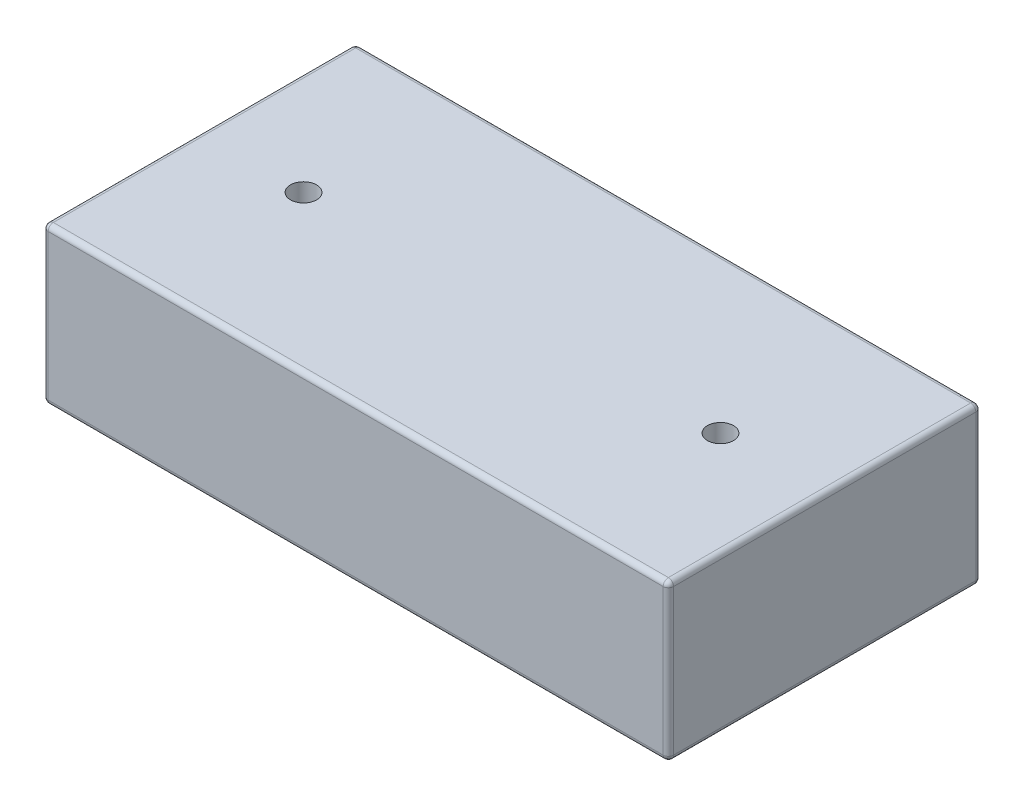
ISO-10303-21;
HEADER;
FILE_DESCRIPTION(('STEP AP214'),'2;1');
FILE_NAME('part.step','',(''),(''),'','','');
FILE_SCHEMA(('AUTOMOTIVE_DESIGN { 1 0 10303 214 1 1 1 1 }'));
ENDSEC;
DATA;
#1=APPLICATION_CONTEXT('core data for automotive mechanical design processes');
#2=APPLICATION_PROTOCOL_DEFINITION('international standard','automotive_design',2000,#1);
#3=PRODUCT_CONTEXT('',#1,'mechanical');
#4=PRODUCT('Part','Part','',(#3));
#5=PRODUCT_RELATED_PRODUCT_CATEGORY('part','',(#4));
#6=PRODUCT_DEFINITION_FORMATION('','',#4);
#7=PRODUCT_DEFINITION_CONTEXT('part definition',#1,'design');
#8=PRODUCT_DEFINITION('design','',#6,#7);
#9=PRODUCT_DEFINITION_SHAPE('','',#8);
#10=(LENGTH_UNIT() NAMED_UNIT(*) SI_UNIT(.MILLI.,.METRE.));
#11=(NAMED_UNIT(*) PLANE_ANGLE_UNIT() SI_UNIT($,.RADIAN.));
#12=(NAMED_UNIT(*) SI_UNIT($,.STERADIAN.) SOLID_ANGLE_UNIT());
#13=UNCERTAINTY_MEASURE_WITH_UNIT(LENGTH_MEASURE(1.E-05),#10,'distance_accuracy_value','');
#14=(GEOMETRIC_REPRESENTATION_CONTEXT(3) GLOBAL_UNCERTAINTY_ASSIGNED_CONTEXT((#13)) GLOBAL_UNIT_ASSIGNED_CONTEXT((#10,
#11,#12)) REPRESENTATION_CONTEXT('',''));
#15=CARTESIAN_POINT('',(0.,0.,0.));
#16=DIRECTION('',(0.,0.,1.));
#17=DIRECTION('',(1.,0.,0.));
#18=AXIS2_PLACEMENT_3D('',#15,#16,#17);
#19=CARTESIAN_POINT('',(304.8,76.2,-152.4));
#20=DIRECTION('',(-1.,0.,0.));
#21=DIRECTION('',(0.,0.,1.));
#22=AXIS2_PLACEMENT_3D('',#19,#20,#21);
#23=PLANE('',#22);
#24=DIRECTION('',(0.,0.,-1.));
#25=VECTOR('',#24,1.);
#26=CARTESIAN_POINT('',(304.8,-71.12,-152.4));
#27=LINE('',#26,#25);
#28=CARTESIAN_POINT('',(304.8,-71.12,147.32));
#29=VERTEX_POINT('',#28);
#30=CARTESIAN_POINT('',(304.8,-71.12,-147.32));
#31=VERTEX_POINT('',#30);
#32=EDGE_CURVE('E197',#29,#31,#27,.T.);
#33=ORIENTED_EDGE('',*,*,#32,.T.);
#34=DIRECTION('',(0.,-1.,0.));
#35=VECTOR('',#34,1.);
#36=CARTESIAN_POINT('',(304.8,76.2,-147.32));
#37=LINE('',#36,#35);
#38=CARTESIAN_POINT('',(304.8,71.12,-147.32));
#39=VERTEX_POINT('',#38);
#40=EDGE_CURVE('E44',#31,#39,#37,.F.);
#41=ORIENTED_EDGE('',*,*,#40,.T.);
#42=DIRECTION('',(0.,0.,-1.));
#43=VECTOR('',#42,1.);
#44=CARTESIAN_POINT('',(304.8,71.12,-152.4));
#45=LINE('',#44,#43);
#46=CARTESIAN_POINT('',(304.8,71.12,147.32));
#47=VERTEX_POINT('',#46);
#48=EDGE_CURVE('E172',#39,#47,#45,.F.);
#49=ORIENTED_EDGE('',*,*,#48,.T.);
#50=DIRECTION('',(0.,-1.,0.));
#51=VECTOR('',#50,1.);
#52=CARTESIAN_POINT('',(304.8,76.2,147.32));
#53=LINE('',#52,#51);
#54=EDGE_CURVE('E240',#47,#29,#53,.T.);
#55=ORIENTED_EDGE('',*,*,#54,.T.);
#56=EDGE_LOOP('',(#33,#41,#49,#55));
#57=FACE_BOUND('',#56,.T.);
#58=ADVANCED_FACE('F37',(#57),#23,.F.);
#59=CARTESIAN_POINT('',(304.8,76.2,-152.4));
#60=DIRECTION('',(0.,0.,1.));
#61=DIRECTION('',(1.,0.,0.));
#62=AXIS2_PLACEMENT_3D('',#59,#60,#61);
#63=PLANE('',#62);
#64=DIRECTION('',(-1.,0.,0.));
#65=VECTOR('',#64,1.);
#66=CARTESIAN_POINT('',(304.8,71.12,-152.4));
#67=LINE('',#66,#65);
#68=CARTESIAN_POINT('',(-299.72,71.12,-152.4));
#69=VERTEX_POINT('',#68);
#70=CARTESIAN_POINT('',(299.72,71.12,-152.4));
#71=VERTEX_POINT('',#70);
#72=EDGE_CURVE('E146',#69,#71,#67,.F.);
#73=ORIENTED_EDGE('',*,*,#72,.T.);
#74=DIRECTION('',(0.,-1.,0.));
#75=VECTOR('',#74,1.);
#76=CARTESIAN_POINT('',(299.72,76.2,-152.4));
#77=LINE('',#76,#75);
#78=CARTESIAN_POINT('',(299.72,-71.12,-152.4));
#79=VERTEX_POINT('',#78);
#80=EDGE_CURVE('E238',#71,#79,#77,.T.);
#81=ORIENTED_EDGE('',*,*,#80,.T.);
#82=DIRECTION('',(-1.,0.,0.));
#83=VECTOR('',#82,1.);
#84=CARTESIAN_POINT('',(-304.8,-71.12,-152.4));
#85=LINE('',#84,#83);
#86=CARTESIAN_POINT('',(-299.72,-71.12,-152.4));
#87=VERTEX_POINT('',#86);
#88=EDGE_CURVE('E147',#79,#87,#85,.T.);
#89=ORIENTED_EDGE('',*,*,#88,.T.);
#90=DIRECTION('',(0.,-1.,0.));
#91=VECTOR('',#90,1.);
#92=CARTESIAN_POINT('',(-299.72,76.2,-152.4));
#93=LINE('',#92,#91);
#94=EDGE_CURVE('E207',#87,#69,#93,.F.);
#95=ORIENTED_EDGE('',*,*,#94,.T.);
#96=EDGE_LOOP('',(#73,#81,#89,#95));
#97=FACE_BOUND('',#96,.T.);
#98=ADVANCED_FACE('F263',(#97),#63,.F.);
#99=CARTESIAN_POINT('',(-304.8,76.2,-152.4));
#100=DIRECTION('',(1.,0.,0.));
#101=DIRECTION('',(0.,0.,-1.));
#102=AXIS2_PLACEMENT_3D('',#99,#100,#101);
#103=PLANE('',#102);
#104=DIRECTION('',(0.,0.,1.));
#105=VECTOR('',#104,1.);
#106=CARTESIAN_POINT('',(-304.8,-71.12,152.4));
#107=LINE('',#106,#105);
#108=CARTESIAN_POINT('',(-304.8,-71.12,-147.32));
#109=VERTEX_POINT('',#108);
#110=CARTESIAN_POINT('',(-304.8,-71.12,147.32));
#111=VERTEX_POINT('',#110);
#112=EDGE_CURVE('E180',#109,#111,#107,.T.);
#113=ORIENTED_EDGE('',*,*,#112,.T.);
#114=DIRECTION('',(0.,-1.,0.));
#115=VECTOR('',#114,1.);
#116=CARTESIAN_POINT('',(-304.8,76.2,147.32));
#117=LINE('',#116,#115);
#118=CARTESIAN_POINT('',(-304.8,71.12,147.32));
#119=VERTEX_POINT('',#118);
#120=EDGE_CURVE('E219',#111,#119,#117,.F.);
#121=ORIENTED_EDGE('',*,*,#120,.T.);
#122=DIRECTION('',(0.,0.,1.));
#123=VECTOR('',#122,1.);
#124=CARTESIAN_POINT('',(-304.8,71.12,-152.4));
#125=LINE('',#124,#123);
#126=CARTESIAN_POINT('',(-304.8,71.12,-147.32));
#127=VERTEX_POINT('',#126);
#128=EDGE_CURVE('E178',#119,#127,#125,.F.);
#129=ORIENTED_EDGE('',*,*,#128,.T.);
#130=DIRECTION('',(0.,-1.,0.));
#131=VECTOR('',#130,1.);
#132=CARTESIAN_POINT('',(-304.8,76.2,-147.32));
#133=LINE('',#132,#131);
#134=EDGE_CURVE('E205',#127,#109,#133,.T.);
#135=ORIENTED_EDGE('',*,*,#134,.T.);
#136=EDGE_LOOP('',(#113,#121,#129,#135));
#137=FACE_BOUND('',#136,.T.);
#138=ADVANCED_FACE('F299',(#137),#103,.F.);
#139=CARTESIAN_POINT('',(304.8,76.2,152.4));
#140=DIRECTION('',(0.,0.,-1.));
#141=DIRECTION('',(-1.,0.,0.));
#142=AXIS2_PLACEMENT_3D('',#139,#140,#141);
#143=PLANE('',#142);
#144=DIRECTION('',(1.,0.,0.));
#145=VECTOR('',#144,1.);
#146=CARTESIAN_POINT('',(304.8,-71.12,152.4));
#147=LINE('',#146,#145);
#148=CARTESIAN_POINT('',(-299.72,-71.12,152.4));
#149=VERTEX_POINT('',#148);
#150=CARTESIAN_POINT('',(299.72,-71.12,152.4));
#151=VERTEX_POINT('',#150);
#152=EDGE_CURVE('E195',#149,#151,#147,.T.);
#153=ORIENTED_EDGE('',*,*,#152,.T.);
#154=DIRECTION('',(0.,-1.,0.));
#155=VECTOR('',#154,1.);
#156=CARTESIAN_POINT('',(299.72,76.2,152.4));
#157=LINE('',#156,#155);
#158=CARTESIAN_POINT('',(299.72,71.12,152.4));
#159=VERTEX_POINT('',#158);
#160=EDGE_CURVE('E11',#151,#159,#157,.F.);
#161=ORIENTED_EDGE('',*,*,#160,.T.);
#162=DIRECTION('',(1.,0.,0.));
#163=VECTOR('',#162,1.);
#164=CARTESIAN_POINT('',(304.8,71.12,152.4));
#165=LINE('',#164,#163);
#166=CARTESIAN_POINT('',(-299.72,71.12,152.4));
#167=VERTEX_POINT('',#166);
#168=EDGE_CURVE('E175',#159,#167,#165,.F.);
#169=ORIENTED_EDGE('',*,*,#168,.T.);
#170=DIRECTION('',(0.,-1.,0.));
#171=VECTOR('',#170,1.);
#172=CARTESIAN_POINT('',(-299.72,76.2,152.4));
#173=LINE('',#172,#171);
#174=EDGE_CURVE('E217',#167,#149,#173,.T.);
#175=ORIENTED_EDGE('',*,*,#174,.T.);
#176=EDGE_LOOP('',(#153,#161,#169,#175));
#177=FACE_BOUND('',#176,.T.);
#178=ADVANCED_FACE('F291',(#177),#143,.F.);
#179=CARTESIAN_POINT('',(304.8,76.2,-152.4));
#180=DIRECTION('',(0.,-1.,0.));
#181=DIRECTION('',(0.,0.,-1.));
#182=AXIS2_PLACEMENT_3D('',#179,#180,#181);
#183=PLANE('',#182);
#184=DIRECTION('',(1.,0.,0.));
#185=VECTOR('',#184,1.);
#186=CARTESIAN_POINT('',(304.8,76.2,147.32));
#187=LINE('',#186,#185);
#188=CARTESIAN_POINT('',(-299.72,76.2,147.32));
#189=VERTEX_POINT('',#188);
#190=CARTESIAN_POINT('',(299.72,76.2,147.32));
#191=VERTEX_POINT('',#190);
#192=EDGE_CURVE('E158',#189,#191,#187,.T.);
#193=ORIENTED_EDGE('',*,*,#192,.T.);
#194=DIRECTION('',(0.,0.,-1.));
#195=VECTOR('',#194,1.);
#196=CARTESIAN_POINT('',(299.72,76.2,-152.4));
#197=LINE('',#196,#195);
#198=CARTESIAN_POINT('',(299.72,76.2,-147.32));
#199=VERTEX_POINT('',#198);
#200=EDGE_CURVE('E157',#191,#199,#197,.T.);
#201=ORIENTED_EDGE('',*,*,#200,.T.);
#202=DIRECTION('',(-1.,0.,0.));
#203=VECTOR('',#202,1.);
#204=CARTESIAN_POINT('',(304.8,76.2,-147.32));
#205=LINE('',#204,#203);
#206=CARTESIAN_POINT('',(-299.72,76.2,-147.32));
#207=VERTEX_POINT('',#206);
#208=EDGE_CURVE('E143',#199,#207,#205,.T.);
#209=ORIENTED_EDGE('',*,*,#208,.T.);
#210=DIRECTION('',(0.,0.,1.));
#211=VECTOR('',#210,1.);
#212=CARTESIAN_POINT('',(-299.72,76.2,-152.4));
#213=LINE('',#212,#211);
#214=EDGE_CURVE('E154',#207,#189,#213,.T.);
#215=ORIENTED_EDGE('',*,*,#214,.T.);
#216=EDGE_LOOP('',(#193,#201,#209,#215));
#217=FACE_BOUND('',#216,.T.);
#218=CARTESIAN_POINT('',(203.2,76.2,0.));
#219=DIRECTION('',(0.,1.,0.));
#220=DIRECTION('',(0.,0.,1.));
#221=AXIS2_PLACEMENT_3D('',#218,#219,#220);
#222=CIRCLE('',#221,12.7);
#223=CARTESIAN_POINT('',(203.2,76.2,12.7));
#224=VERTEX_POINT('',#223);
#225=EDGE_CURVE('E273',#224,#224,#222,.T.);
#226=ORIENTED_EDGE('',*,*,#225,.F.);
#227=EDGE_LOOP('',(#226));
#228=FACE_BOUND('',#227,.T.);
#229=CARTESIAN_POINT('',(-203.2,76.2,0.));
#230=DIRECTION('',(0.,1.,0.));
#231=DIRECTION('',(0.,0.,1.));
#232=AXIS2_PLACEMENT_3D('',#229,#230,#231);
#233=CIRCLE('',#232,12.7);
#234=CARTESIAN_POINT('',(-203.2,76.2,12.7));
#235=VERTEX_POINT('',#234);
#236=EDGE_CURVE('E166',#235,#235,#233,.T.);
#237=ORIENTED_EDGE('',*,*,#236,.F.);
#238=EDGE_LOOP('',(#237));
#239=FACE_BOUND('',#238,.T.);
#240=ADVANCED_FACE('F152',(#217,#228,#239),#183,.F.);
#241=CARTESIAN_POINT('',(304.8,-76.2,-152.4));
#242=DIRECTION('',(0.,-1.,0.));
#243=DIRECTION('',(0.,0.,-1.));
#244=AXIS2_PLACEMENT_3D('',#241,#242,#243);
#245=PLANE('',#244);
#246=DIRECTION('',(1.,0.,0.));
#247=VECTOR('',#246,1.);
#248=CARTESIAN_POINT('',(-304.8,-76.2,147.32));
#249=LINE('',#248,#247);
#250=CARTESIAN_POINT('',(299.72,-76.2,147.32));
#251=VERTEX_POINT('',#250);
#252=CARTESIAN_POINT('',(-299.72,-76.2,147.32));
#253=VERTEX_POINT('',#252);
#254=EDGE_CURVE('E189',#251,#253,#249,.F.);
#255=ORIENTED_EDGE('',*,*,#254,.T.);
#256=DIRECTION('',(0.,0.,1.));
#257=VECTOR('',#256,1.);
#258=CARTESIAN_POINT('',(-299.72,-76.2,-152.4));
#259=LINE('',#258,#257);
#260=CARTESIAN_POINT('',(-299.72,-76.2,-147.32));
#261=VERTEX_POINT('',#260);
#262=EDGE_CURVE('E192',#253,#261,#259,.F.);
#263=ORIENTED_EDGE('',*,*,#262,.T.);
#264=DIRECTION('',(-1.,0.,0.));
#265=VECTOR('',#264,1.);
#266=CARTESIAN_POINT('',(304.8,-76.2,-147.32));
#267=LINE('',#266,#265);
#268=CARTESIAN_POINT('',(299.72,-76.2,-147.32));
#269=VERTEX_POINT('',#268);
#270=EDGE_CURVE('E183',#261,#269,#267,.F.);
#271=ORIENTED_EDGE('',*,*,#270,.T.);
#272=DIRECTION('',(0.,0.,-1.));
#273=VECTOR('',#272,1.);
#274=CARTESIAN_POINT('',(299.72,-76.2,152.4));
#275=LINE('',#274,#273);
#276=EDGE_CURVE('E186',#269,#251,#275,.F.);
#277=ORIENTED_EDGE('',*,*,#276,.T.);
#278=EDGE_LOOP('',(#255,#263,#271,#277));
#279=FACE_BOUND('',#278,.T.);
#280=CARTESIAN_POINT('',(203.2,-76.2,0.));
#281=DIRECTION('',(0.,1.,0.));
#282=DIRECTION('',(0.,0.,1.));
#283=AXIS2_PLACEMENT_3D('',#280,#281,#282);
#284=CIRCLE('',#283,12.7);
#285=CARTESIAN_POINT('',(203.2,-76.2,12.7));
#286=VERTEX_POINT('',#285);
#287=EDGE_CURVE('E282',#286,#286,#284,.T.);
#288=ORIENTED_EDGE('',*,*,#287,.T.);
#289=EDGE_LOOP('',(#288));
#290=FACE_BOUND('',#289,.T.);
#291=CARTESIAN_POINT('',(-203.2,-76.2,0.));
#292=DIRECTION('',(0.,1.,0.));
#293=DIRECTION('',(0.,0.,1.));
#294=AXIS2_PLACEMENT_3D('',#291,#292,#293);
#295=CIRCLE('',#294,12.7);
#296=CARTESIAN_POINT('',(-203.2,-76.2,12.7));
#297=VERTEX_POINT('',#296);
#298=EDGE_CURVE('E163',#297,#297,#295,.T.);
#299=ORIENTED_EDGE('',*,*,#298,.T.);
#300=EDGE_LOOP('',(#299));
#301=FACE_BOUND('',#300,.T.);
#302=ADVANCED_FACE('F290',(#279,#290,#301),#245,.T.);
#303=CARTESIAN_POINT('',(-203.2,-76.2,0.));
#304=DIRECTION('',(0.,1.,0.));
#305=DIRECTION('',(0.,0.,1.));
#306=AXIS2_PLACEMENT_3D('',#303,#304,#305);
#307=CYLINDRICAL_SURFACE('',#306,12.7);
#308=CARTESIAN_POINT('',(-203.2,-76.2,12.7));
#309=CARTESIAN_POINT('',(-203.2,-74.6125,12.7));
#310=CARTESIAN_POINT('',(-203.2,-73.025,12.7));
#311=CARTESIAN_POINT('',(-203.2,-69.85,12.7));
#312=CARTESIAN_POINT('',(-203.2,-68.2625,12.7));
#313=CARTESIAN_POINT('',(-203.2,-65.0875,12.7));
#314=CARTESIAN_POINT('',(-203.2,-63.5,12.7));
#315=CARTESIAN_POINT('',(-203.2,-60.325,12.7));
#316=CARTESIAN_POINT('',(-203.2,-58.7375,12.7));
#317=CARTESIAN_POINT('',(-203.2,-55.5625,12.7));
#318=CARTESIAN_POINT('',(-203.2,-53.975,12.7));
#319=CARTESIAN_POINT('',(-203.2,-50.8,12.7));
#320=CARTESIAN_POINT('',(-203.2,-49.2125,12.7));
#321=CARTESIAN_POINT('',(-203.2,-46.0375,12.7));
#322=CARTESIAN_POINT('',(-203.2,-44.45,12.7));
#323=CARTESIAN_POINT('',(-203.2,-41.275,12.7));
#324=CARTESIAN_POINT('',(-203.2,-39.6875,12.7));
#325=CARTESIAN_POINT('',(-203.2,-36.5125,12.7));
#326=CARTESIAN_POINT('',(-203.2,-34.925,12.7));
#327=CARTESIAN_POINT('',(-203.2,-31.75,12.7));
#328=CARTESIAN_POINT('',(-203.2,-30.1625,12.7));
#329=CARTESIAN_POINT('',(-203.2,-26.9875,12.7));
#330=CARTESIAN_POINT('',(-203.2,-25.4,12.7));
#331=CARTESIAN_POINT('',(-203.2,-22.225,12.7));
#332=CARTESIAN_POINT('',(-203.2,-20.6375,12.7));
#333=CARTESIAN_POINT('',(-203.2,-17.4625,12.7));
#334=CARTESIAN_POINT('',(-203.2,-15.875,12.7));
#335=CARTESIAN_POINT('',(-203.2,-12.7,12.7));
#336=CARTESIAN_POINT('',(-203.2,-11.1125,12.7));
#337=CARTESIAN_POINT('',(-203.2,-7.93750000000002,12.7));
#338=CARTESIAN_POINT('',(-203.2,-6.35000000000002,12.7));
#339=CARTESIAN_POINT('',(-203.2,-3.17500000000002,12.7));
#340=CARTESIAN_POINT('',(-203.2,-1.58750000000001,12.7));
#341=CARTESIAN_POINT('',(-203.2,1.58749999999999,12.7));
#342=CARTESIAN_POINT('',(-203.2,3.17499999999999,12.7));
#343=CARTESIAN_POINT('',(-203.2,6.34999999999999,12.7));
#344=CARTESIAN_POINT('',(-203.2,7.93749999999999,12.7));
#345=CARTESIAN_POINT('',(-203.2,11.1125,12.7));
#346=CARTESIAN_POINT('',(-203.2,12.7,12.7));
#347=CARTESIAN_POINT('',(-203.2,15.875,12.7));
#348=CARTESIAN_POINT('',(-203.2,17.4625,12.7));
#349=CARTESIAN_POINT('',(-203.2,20.6375,12.7));
#350=CARTESIAN_POINT('',(-203.2,22.225,12.7));
#351=CARTESIAN_POINT('',(-203.2,25.4,12.7));
#352=CARTESIAN_POINT('',(-203.2,26.9875,12.7));
#353=CARTESIAN_POINT('',(-203.2,30.1625,12.7));
#354=CARTESIAN_POINT('',(-203.2,31.75,12.7));
#355=CARTESIAN_POINT('',(-203.2,34.925,12.7));
#356=CARTESIAN_POINT('',(-203.2,36.5125,12.7));
#357=CARTESIAN_POINT('',(-203.2,39.6875,12.7));
#358=CARTESIAN_POINT('',(-203.2,41.275,12.7));
#359=CARTESIAN_POINT('',(-203.2,44.45,12.7));
#360=CARTESIAN_POINT('',(-203.2,46.0375,12.7));
#361=CARTESIAN_POINT('',(-203.2,49.2125,12.7));
#362=CARTESIAN_POINT('',(-203.2,50.8,12.7));
#363=CARTESIAN_POINT('',(-203.2,53.975,12.7));
#364=CARTESIAN_POINT('',(-203.2,55.5625,12.7));
#365=CARTESIAN_POINT('',(-203.2,58.7375,12.7));
#366=CARTESIAN_POINT('',(-203.2,60.325,12.7));
#367=CARTESIAN_POINT('',(-203.2,63.5,12.7));
#368=CARTESIAN_POINT('',(-203.2,65.0875,12.7));
#369=CARTESIAN_POINT('',(-203.2,68.2625,12.7));
#370=CARTESIAN_POINT('',(-203.2,69.85,12.7));
#371=CARTESIAN_POINT('',(-203.2,73.025,12.7));
#372=CARTESIAN_POINT('',(-203.2,74.6125,12.7));
#373=CARTESIAN_POINT('',(-203.2,76.2,12.7));
#374=B_SPLINE_CURVE_WITH_KNOTS('',3,(#308,#309,#310,#311,#312,#313,#314,#315,#316,#317,#318,
#319,#320,#321,#322,#323,#324,#325,#326,#327,#328,#329,#330,#331,#332,#333,#334,#335,#336,#337,
#338,#339,#340,#341,#342,#343,#344,#345,#346,#347,#348,#349,#350,#351,#352,#353,#354,#355,#356,
#357,#358,#359,#360,#361,#362,#363,#364,#365,#366,#367,#368,#369,#370,#371,#372,#373),
.UNSPECIFIED.,.F.,.F.,(4,2,2,2,2,2,2,2,2,2,2,2,2,2,2,2,2,2,2,2,2,2,2,2,2,2,2,2,2,2,2,2,4),(0.,
4.7625,9.52500000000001,14.2875,19.05,23.8125,28.575,33.3375,38.1,42.8625,47.625,52.3875,57.15,
61.9125,66.675,71.4375,76.2,80.9625,85.725,90.4875,95.25,100.0125,104.775,109.5375,114.3,
119.0625,123.825,128.5875,133.35,138.1125,142.875,147.6375,152.4),.UNSPECIFIED.);
#375=EDGE_CURVE('BSEAM287',#297,#235,#374,.T.);
#376=ORIENTED_EDGE('',*,*,#298,.F.);
#377=ORIENTED_EDGE('',*,*,#236,.T.);
#378=ORIENTED_EDGE('',*,*,#375,.T.);
#379=ORIENTED_EDGE('',*,*,#375,.F.);
#380=EDGE_LOOP('',(#376,#378,#377,#379));
#381=FACE_BOUND('',#380,.T.);
#382=ADVANCED_FACE('F287',(#381),#307,.F.);
#383=CARTESIAN_POINT('',(203.2,-76.2,0.));
#384=DIRECTION('',(0.,1.,0.));
#385=DIRECTION('',(0.,0.,1.));
#386=AXIS2_PLACEMENT_3D('',#383,#384,#385);
#387=CYLINDRICAL_SURFACE('',#386,12.7);
#388=CARTESIAN_POINT('',(203.2,-76.2,12.7));
#389=CARTESIAN_POINT('',(203.2,-74.6125,12.7));
#390=CARTESIAN_POINT('',(203.2,-73.025,12.7));
#391=CARTESIAN_POINT('',(203.2,-69.85,12.7));
#392=CARTESIAN_POINT('',(203.2,-68.2625,12.7));
#393=CARTESIAN_POINT('',(203.2,-65.0875,12.7));
#394=CARTESIAN_POINT('',(203.2,-63.5,12.7));
#395=CARTESIAN_POINT('',(203.2,-60.325,12.7));
#396=CARTESIAN_POINT('',(203.2,-58.7375,12.7));
#397=CARTESIAN_POINT('',(203.2,-55.5625,12.7));
#398=CARTESIAN_POINT('',(203.2,-53.975,12.7));
#399=CARTESIAN_POINT('',(203.2,-50.8,12.7));
#400=CARTESIAN_POINT('',(203.2,-49.2125,12.7));
#401=CARTESIAN_POINT('',(203.2,-46.0375,12.7));
#402=CARTESIAN_POINT('',(203.2,-44.45,12.7));
#403=CARTESIAN_POINT('',(203.2,-41.275,12.7));
#404=CARTESIAN_POINT('',(203.2,-39.6875,12.7));
#405=CARTESIAN_POINT('',(203.2,-36.5125,12.7));
#406=CARTESIAN_POINT('',(203.2,-34.925,12.7));
#407=CARTESIAN_POINT('',(203.2,-31.75,12.7));
#408=CARTESIAN_POINT('',(203.2,-30.1625,12.7));
#409=CARTESIAN_POINT('',(203.2,-26.9875,12.7));
#410=CARTESIAN_POINT('',(203.2,-25.4,12.7));
#411=CARTESIAN_POINT('',(203.2,-22.225,12.7));
#412=CARTESIAN_POINT('',(203.2,-20.6375,12.7));
#413=CARTESIAN_POINT('',(203.2,-17.4625,12.7));
#414=CARTESIAN_POINT('',(203.2,-15.875,12.7));
#415=CARTESIAN_POINT('',(203.2,-12.7,12.7));
#416=CARTESIAN_POINT('',(203.2,-11.1125,12.7));
#417=CARTESIAN_POINT('',(203.2,-7.93750000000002,12.7));
#418=CARTESIAN_POINT('',(203.2,-6.35000000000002,12.7));
#419=CARTESIAN_POINT('',(203.2,-3.17500000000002,12.7));
#420=CARTESIAN_POINT('',(203.2,-1.58750000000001,12.7));
#421=CARTESIAN_POINT('',(203.2,1.58749999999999,12.7));
#422=CARTESIAN_POINT('',(203.2,3.17499999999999,12.7));
#423=CARTESIAN_POINT('',(203.2,6.34999999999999,12.7));
#424=CARTESIAN_POINT('',(203.2,7.93749999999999,12.7));
#425=CARTESIAN_POINT('',(203.2,11.1125,12.7));
#426=CARTESIAN_POINT('',(203.2,12.7,12.7));
#427=CARTESIAN_POINT('',(203.2,15.875,12.7));
#428=CARTESIAN_POINT('',(203.2,17.4625,12.7));
#429=CARTESIAN_POINT('',(203.2,20.6375,12.7));
#430=CARTESIAN_POINT('',(203.2,22.225,12.7));
#431=CARTESIAN_POINT('',(203.2,25.4,12.7));
#432=CARTESIAN_POINT('',(203.2,26.9875,12.7));
#433=CARTESIAN_POINT('',(203.2,30.1625,12.7));
#434=CARTESIAN_POINT('',(203.2,31.75,12.7));
#435=CARTESIAN_POINT('',(203.2,34.925,12.7));
#436=CARTESIAN_POINT('',(203.2,36.5125,12.7));
#437=CARTESIAN_POINT('',(203.2,39.6875,12.7));
#438=CARTESIAN_POINT('',(203.2,41.275,12.7));
#439=CARTESIAN_POINT('',(203.2,44.45,12.7));
#440=CARTESIAN_POINT('',(203.2,46.0375,12.7));
#441=CARTESIAN_POINT('',(203.2,49.2125,12.7));
#442=CARTESIAN_POINT('',(203.2,50.8,12.7));
#443=CARTESIAN_POINT('',(203.2,53.975,12.7));
#444=CARTESIAN_POINT('',(203.2,55.5625,12.7));
#445=CARTESIAN_POINT('',(203.2,58.7375,12.7));
#446=CARTESIAN_POINT('',(203.2,60.325,12.7));
#447=CARTESIAN_POINT('',(203.2,63.5,12.7));
#448=CARTESIAN_POINT('',(203.2,65.0875,12.7));
#449=CARTESIAN_POINT('',(203.2,68.2625,12.7));
#450=CARTESIAN_POINT('',(203.2,69.85,12.7));
#451=CARTESIAN_POINT('',(203.2,73.025,12.7));
#452=CARTESIAN_POINT('',(203.2,74.6125,12.7));
#453=CARTESIAN_POINT('',(203.2,76.2,12.7));
#454=B_SPLINE_CURVE_WITH_KNOTS('',3,(#388,#389,#390,#391,#392,#393,#394,#395,#396,#397,#398,
#399,#400,#401,#402,#403,#404,#405,#406,#407,#408,#409,#410,#411,#412,#413,#414,#415,#416,#417,
#418,#419,#420,#421,#422,#423,#424,#425,#426,#427,#428,#429,#430,#431,#432,#433,#434,#435,#436,
#437,#438,#439,#440,#441,#442,#443,#444,#445,#446,#447,#448,#449,#450,#451,#452,#453),
.UNSPECIFIED.,.F.,.F.,(4,2,2,2,2,2,2,2,2,2,2,2,2,2,2,2,2,2,2,2,2,2,2,2,2,2,2,2,2,2,2,2,4),(0.,
4.7625,9.52500000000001,14.2875,19.05,23.8125,28.575,33.3375,38.1,42.8625,47.625,52.3875,57.15,
61.9125,66.675,71.4375,76.2,80.9625,85.725,90.4875,95.25,100.0125,104.775,109.5375,114.3,
119.0625,123.825,128.5875,133.35,138.1125,142.875,147.6375,152.4),.UNSPECIFIED.);
#455=EDGE_CURVE('BSEAM401',#286,#224,#454,.T.);
#456=ORIENTED_EDGE('',*,*,#287,.F.);
#457=ORIENTED_EDGE('',*,*,#225,.T.);
#458=ORIENTED_EDGE('',*,*,#455,.T.);
#459=ORIENTED_EDGE('',*,*,#455,.F.);
#460=EDGE_LOOP('',(#456,#458,#457,#459));
#461=FACE_BOUND('',#460,.T.);
#462=ADVANCED_FACE('F401',(#461),#387,.F.);
#463=CARTESIAN_POINT('',(-299.72,71.12,-152.4));
#464=DIRECTION('',(0.,0.,1.));
#465=DIRECTION('',(1.,0.,0.));
#466=AXIS2_PLACEMENT_3D('',#463,#464,#465);
#467=CYLINDRICAL_SURFACE('',#466,5.08);
#468=ORIENTED_EDGE('',*,*,#128,.F.);
#469=CARTESIAN_POINT('',(-299.72,71.12,147.32));
#470=DIRECTION('',(0.,0.,1.));
#471=DIRECTION('',(1.,0.,0.));
#472=AXIS2_PLACEMENT_3D('',#469,#470,#471);
#473=CIRCLE('',#472,5.08);
#474=EDGE_CURVE('E162',#119,#189,#473,.F.);
#475=ORIENTED_EDGE('',*,*,#474,.T.);
#476=ORIENTED_EDGE('',*,*,#214,.F.);
#477=CARTESIAN_POINT('',(-299.72,71.12,-147.32));
#478=DIRECTION('',(0.,0.,1.));
#479=DIRECTION('',(1.,0.,0.));
#480=AXIS2_PLACEMENT_3D('',#477,#478,#479);
#481=CIRCLE('',#480,5.08);
#482=EDGE_CURVE('E126',#207,#127,#481,.T.);
#483=ORIENTED_EDGE('',*,*,#482,.T.);
#484=EDGE_LOOP('',(#468,#475,#476,#483));
#485=FACE_BOUND('',#484,.T.);
#486=ADVANCED_FACE('F160',(#485),#467,.T.);
#487=CARTESIAN_POINT('',(304.8,71.12,147.32));
#488=DIRECTION('',(1.,0.,0.));
#489=DIRECTION('',(0.,0.,-1.));
#490=AXIS2_PLACEMENT_3D('',#487,#488,#489);
#491=CYLINDRICAL_SURFACE('',#490,5.08);
#492=ORIENTED_EDGE('',*,*,#168,.F.);
#493=CARTESIAN_POINT('',(299.72,71.12,147.32));
#494=DIRECTION('',(1.,0.,0.));
#495=DIRECTION('',(0.,0.,-1.));
#496=AXIS2_PLACEMENT_3D('',#493,#494,#495);
#497=CIRCLE('',#496,5.08);
#498=EDGE_CURVE('E235',#159,#191,#497,.F.);
#499=ORIENTED_EDGE('',*,*,#498,.T.);
#500=ORIENTED_EDGE('',*,*,#192,.F.);
#501=CARTESIAN_POINT('',(-299.72,71.12,147.32));
#502=DIRECTION('',(1.,0.,0.));
#503=DIRECTION('',(0.,0.,-1.));
#504=AXIS2_PLACEMENT_3D('',#501,#502,#503);
#505=CIRCLE('',#504,5.08);
#506=EDGE_CURVE('E209',#189,#167,#505,.T.);
#507=ORIENTED_EDGE('',*,*,#506,.T.);
#508=EDGE_LOOP('',(#492,#499,#500,#507));
#509=FACE_BOUND('',#508,.T.);
#510=ADVANCED_FACE('F395',(#509),#491,.T.);
#511=CARTESIAN_POINT('',(304.8,71.12,-147.32));
#512=DIRECTION('',(-1.,0.,0.));
#513=DIRECTION('',(0.,0.,1.));
#514=AXIS2_PLACEMENT_3D('',#511,#512,#513);
#515=CYLINDRICAL_SURFACE('',#514,5.08);
#516=ORIENTED_EDGE('',*,*,#208,.F.);
#517=CARTESIAN_POINT('',(299.72,71.12,-147.32));
#518=DIRECTION('',(-1.,0.,0.));
#519=DIRECTION('',(0.,0.,1.));
#520=AXIS2_PLACEMENT_3D('',#517,#518,#519);
#521=CIRCLE('',#520,5.08);
#522=EDGE_CURVE('E227',#199,#71,#521,.T.);
#523=ORIENTED_EDGE('',*,*,#522,.T.);
#524=ORIENTED_EDGE('',*,*,#72,.F.);
#525=CARTESIAN_POINT('',(-299.72,71.12,-147.32));
#526=DIRECTION('',(-1.,0.,0.));
#527=DIRECTION('',(0.,0.,1.));
#528=AXIS2_PLACEMENT_3D('',#525,#526,#527);
#529=CIRCLE('',#528,5.08);
#530=EDGE_CURVE('E129',#69,#207,#529,.F.);
#531=ORIENTED_EDGE('',*,*,#530,.T.);
#532=EDGE_LOOP('',(#516,#523,#524,#531));
#533=FACE_BOUND('',#532,.T.);
#534=ADVANCED_FACE('F142',(#533),#515,.T.);
#535=CARTESIAN_POINT('',(299.72,71.12,-152.4));
#536=DIRECTION('',(0.,0.,-1.));
#537=DIRECTION('',(-1.,0.,0.));
#538=AXIS2_PLACEMENT_3D('',#535,#536,#537);
#539=CYLINDRICAL_SURFACE('',#538,5.08);
#540=ORIENTED_EDGE('',*,*,#48,.F.);
#541=CARTESIAN_POINT('',(299.72,71.12,-147.32));
#542=DIRECTION('',(0.,0.,-1.));
#543=DIRECTION('',(-1.,0.,0.));
#544=AXIS2_PLACEMENT_3D('',#541,#542,#543);
#545=CIRCLE('',#544,5.08);
#546=EDGE_CURVE('E224',#39,#199,#545,.F.);
#547=ORIENTED_EDGE('',*,*,#546,.T.);
#548=ORIENTED_EDGE('',*,*,#200,.F.);
#549=CARTESIAN_POINT('',(299.72,71.12,147.32));
#550=DIRECTION('',(0.,0.,-1.));
#551=DIRECTION('',(-1.,0.,0.));
#552=AXIS2_PLACEMENT_3D('',#549,#550,#551);
#553=CIRCLE('',#552,5.08);
#554=EDGE_CURVE('E221',#191,#47,#553,.T.);
#555=ORIENTED_EDGE('',*,*,#554,.T.);
#556=EDGE_LOOP('',(#540,#547,#548,#555));
#557=FACE_BOUND('',#556,.T.);
#558=ADVANCED_FACE('F250',(#557),#539,.T.);
#559=CARTESIAN_POINT('',(299.72,-71.12,-152.4));
#560=DIRECTION('',(0.,0.,1.));
#561=DIRECTION('',(1.,0.,0.));
#562=AXIS2_PLACEMENT_3D('',#559,#560,#561);
#563=CYLINDRICAL_SURFACE('',#562,5.08);
#564=ORIENTED_EDGE('',*,*,#276,.F.);
#565=CARTESIAN_POINT('',(299.72,-71.12,-147.32));
#566=DIRECTION('',(0.,0.,1.));
#567=DIRECTION('',(1.,0.,0.));
#568=AXIS2_PLACEMENT_3D('',#565,#566,#567);
#569=CIRCLE('',#568,5.08);
#570=EDGE_CURVE('E233',#269,#31,#569,.T.);
#571=ORIENTED_EDGE('',*,*,#570,.T.);
#572=ORIENTED_EDGE('',*,*,#32,.F.);
#573=CARTESIAN_POINT('',(299.72,-71.12,147.32));
#574=DIRECTION('',(0.,0.,1.));
#575=DIRECTION('',(1.,0.,0.));
#576=AXIS2_PLACEMENT_3D('',#573,#574,#575);
#577=CIRCLE('',#576,5.08);
#578=EDGE_CURVE('E231',#29,#251,#577,.F.);
#579=ORIENTED_EDGE('',*,*,#578,.T.);
#580=EDGE_LOOP('',(#564,#571,#572,#579));
#581=FACE_BOUND('',#580,.T.);
#582=ADVANCED_FACE('F344',(#581),#563,.T.);
#583=CARTESIAN_POINT('',(304.8,-71.12,-147.32));
#584=DIRECTION('',(1.,0.,0.));
#585=DIRECTION('',(0.,0.,-1.));
#586=AXIS2_PLACEMENT_3D('',#583,#584,#585);
#587=CYLINDRICAL_SURFACE('',#586,5.08);
#588=ORIENTED_EDGE('',*,*,#88,.F.);
#589=CARTESIAN_POINT('',(299.72,-71.12,-147.32));
#590=DIRECTION('',(1.,0.,0.));
#591=DIRECTION('',(0.,0.,-1.));
#592=AXIS2_PLACEMENT_3D('',#589,#590,#591);
#593=CIRCLE('',#592,5.08);
#594=EDGE_CURVE('E229',#79,#269,#593,.F.);
#595=ORIENTED_EDGE('',*,*,#594,.T.);
#596=ORIENTED_EDGE('',*,*,#270,.F.);
#597=CARTESIAN_POINT('',(-299.72,-71.12,-147.32));
#598=DIRECTION('',(1.,0.,0.));
#599=DIRECTION('',(0.,0.,-1.));
#600=AXIS2_PLACEMENT_3D('',#597,#598,#599);
#601=CIRCLE('',#600,5.08);
#602=EDGE_CURVE('E202',#261,#87,#601,.T.);
#603=ORIENTED_EDGE('',*,*,#602,.T.);
#604=EDGE_LOOP('',(#588,#595,#596,#603));
#605=FACE_BOUND('',#604,.T.);
#606=ADVANCED_FACE('F385',(#605),#587,.T.);
#607=CARTESIAN_POINT('',(304.8,-71.12,147.32));
#608=DIRECTION('',(-1.,0.,0.));
#609=DIRECTION('',(0.,0.,1.));
#610=AXIS2_PLACEMENT_3D('',#607,#608,#609);
#611=CYLINDRICAL_SURFACE('',#610,5.08);
#612=ORIENTED_EDGE('',*,*,#254,.F.);
#613=CARTESIAN_POINT('',(299.72,-71.12,147.32));
#614=DIRECTION('',(-1.,0.,0.));
#615=DIRECTION('',(0.,0.,1.));
#616=AXIS2_PLACEMENT_3D('',#613,#614,#615);
#617=CIRCLE('',#616,5.08);
#618=EDGE_CURVE('E51',#251,#151,#617,.T.);
#619=ORIENTED_EDGE('',*,*,#618,.T.);
#620=ORIENTED_EDGE('',*,*,#152,.F.);
#621=CARTESIAN_POINT('',(-299.72,-71.12,147.32));
#622=DIRECTION('',(-1.,0.,0.));
#623=DIRECTION('',(0.,0.,1.));
#624=AXIS2_PLACEMENT_3D('',#621,#622,#623);
#625=CIRCLE('',#624,5.08);
#626=EDGE_CURVE('E215',#149,#253,#625,.F.);
#627=ORIENTED_EDGE('',*,*,#626,.T.);
#628=EDGE_LOOP('',(#612,#619,#620,#627));
#629=FACE_BOUND('',#628,.T.);
#630=ADVANCED_FACE('F382',(#629),#611,.T.);
#631=CARTESIAN_POINT('',(-299.72,-71.12,-152.4));
#632=DIRECTION('',(0.,0.,-1.));
#633=DIRECTION('',(-1.,0.,0.));
#634=AXIS2_PLACEMENT_3D('',#631,#632,#633);
#635=CYLINDRICAL_SURFACE('',#634,5.08);
#636=ORIENTED_EDGE('',*,*,#262,.F.);
#637=CARTESIAN_POINT('',(-299.72,-71.12,147.32));
#638=DIRECTION('',(0.,0.,-1.));
#639=DIRECTION('',(-1.,0.,0.));
#640=AXIS2_PLACEMENT_3D('',#637,#638,#639);
#641=CIRCLE('',#640,5.08);
#642=EDGE_CURVE('E213',#253,#111,#641,.T.);
#643=ORIENTED_EDGE('',*,*,#642,.T.);
#644=ORIENTED_EDGE('',*,*,#112,.F.);
#645=CARTESIAN_POINT('',(-299.72,-71.12,-147.32));
#646=DIRECTION('',(0.,0.,-1.));
#647=DIRECTION('',(-1.,0.,0.));
#648=AXIS2_PLACEMENT_3D('',#645,#646,#647);
#649=CIRCLE('',#648,5.08);
#650=EDGE_CURVE('E136',#109,#261,#649,.F.);
#651=ORIENTED_EDGE('',*,*,#650,.T.);
#652=EDGE_LOOP('',(#636,#643,#644,#651));
#653=FACE_BOUND('',#652,.T.);
#654=ADVANCED_FACE('F378',(#653),#635,.T.);
#655=CARTESIAN_POINT('',(-299.72,-71.12,-147.32));
#656=DIRECTION('',(0.,0.,1.));
#657=DIRECTION('',(1.,0.,0.));
#658=AXIS2_PLACEMENT_3D('',#655,#656,#657);
#659=SPHERICAL_SURFACE('',#658,5.08);
#660=ORIENTED_EDGE('',*,*,#602,.F.);
#661=ORIENTED_EDGE('',*,*,#650,.F.);
#662=CARTESIAN_POINT('',(-299.72,-71.12,-147.32));
#663=DIRECTION('',(0.,1.,0.));
#664=DIRECTION('',(0.,0.,1.));
#665=AXIS2_PLACEMENT_3D('',#662,#663,#664);
#666=CIRCLE('',#665,5.08);
#667=EDGE_CURVE('E270',#87,#109,#666,.T.);
#668=ORIENTED_EDGE('',*,*,#667,.F.);
#669=EDGE_LOOP('',(#660,#661,#668));
#670=FACE_BOUND('',#669,.T.);
#671=ADVANCED_FACE('F375',(#670),#659,.T.);
#672=CARTESIAN_POINT('',(-299.72,76.2,-147.32));
#673=DIRECTION('',(0.,-1.,0.));
#674=DIRECTION('',(0.,0.,-1.));
#675=AXIS2_PLACEMENT_3D('',#672,#673,#674);
#676=CYLINDRICAL_SURFACE('',#675,5.08);
#677=ORIENTED_EDGE('',*,*,#667,.T.);
#678=ORIENTED_EDGE('',*,*,#134,.F.);
#679=CARTESIAN_POINT('',(-299.72,71.12,-147.32));
#680=DIRECTION('',(0.,1.,0.));
#681=DIRECTION('',(0.,0.,1.));
#682=AXIS2_PLACEMENT_3D('',#679,#680,#681);
#683=CIRCLE('',#682,5.08);
#684=EDGE_CURVE('E131',#69,#127,#683,.T.);
#685=ORIENTED_EDGE('',*,*,#684,.F.);
#686=ORIENTED_EDGE('',*,*,#94,.F.);
#687=EDGE_LOOP('',(#677,#678,#685,#686));
#688=FACE_BOUND('',#687,.T.);
#689=ADVANCED_FACE('F268',(#688),#676,.T.);
#690=CARTESIAN_POINT('',(-299.72,71.12,-147.32));
#691=DIRECTION('',(0.,0.,1.));
#692=DIRECTION('',(1.,0.,0.));
#693=AXIS2_PLACEMENT_3D('',#690,#691,#692);
#694=SPHERICAL_SURFACE('',#693,5.08);
#695=ORIENTED_EDGE('',*,*,#684,.T.);
#696=ORIENTED_EDGE('',*,*,#482,.F.);
#697=ORIENTED_EDGE('',*,*,#530,.F.);
#698=EDGE_LOOP('',(#695,#696,#697));
#699=FACE_BOUND('',#698,.T.);
#700=ADVANCED_FACE('F128',(#699),#694,.T.);
#701=CARTESIAN_POINT('',(-299.72,-71.12,147.32));
#702=DIRECTION('',(0.,0.,1.));
#703=DIRECTION('',(1.,0.,0.));
#704=AXIS2_PLACEMENT_3D('',#701,#702,#703);
#705=SPHERICAL_SURFACE('',#704,5.08);
#706=ORIENTED_EDGE('',*,*,#642,.F.);
#707=ORIENTED_EDGE('',*,*,#626,.F.);
#708=CARTESIAN_POINT('',(-299.72,-71.12,147.32));
#709=DIRECTION('',(0.,1.,0.));
#710=DIRECTION('',(0.,0.,1.));
#711=AXIS2_PLACEMENT_3D('',#708,#709,#710);
#712=CIRCLE('',#711,5.08);
#713=EDGE_CURVE('E271',#111,#149,#712,.T.);
#714=ORIENTED_EDGE('',*,*,#713,.F.);
#715=EDGE_LOOP('',(#706,#707,#714));
#716=FACE_BOUND('',#715,.T.);
#717=ADVANCED_FACE('F320',(#716),#705,.T.);
#718=CARTESIAN_POINT('',(-299.72,76.2,147.32));
#719=DIRECTION('',(0.,-1.,0.));
#720=DIRECTION('',(0.,0.,-1.));
#721=AXIS2_PLACEMENT_3D('',#718,#719,#720);
#722=CYLINDRICAL_SURFACE('',#721,5.08);
#723=ORIENTED_EDGE('',*,*,#713,.T.);
#724=ORIENTED_EDGE('',*,*,#174,.F.);
#725=CARTESIAN_POINT('',(-299.72,71.12,147.32));
#726=DIRECTION('',(0.,1.,0.));
#727=DIRECTION('',(0.,0.,1.));
#728=AXIS2_PLACEMENT_3D('',#725,#726,#727);
#729=CIRCLE('',#728,5.08);
#730=EDGE_CURVE('E276',#119,#167,#729,.T.);
#731=ORIENTED_EDGE('',*,*,#730,.F.);
#732=ORIENTED_EDGE('',*,*,#120,.F.);
#733=EDGE_LOOP('',(#723,#724,#731,#732));
#734=FACE_BOUND('',#733,.T.);
#735=ADVANCED_FACE('F324',(#734),#722,.T.);
#736=CARTESIAN_POINT('',(-299.72,71.12,147.32));
#737=DIRECTION('',(0.,0.,1.));
#738=DIRECTION('',(1.,0.,0.));
#739=AXIS2_PLACEMENT_3D('',#736,#737,#738);
#740=SPHERICAL_SURFACE('',#739,5.08);
#741=ORIENTED_EDGE('',*,*,#506,.F.);
#742=ORIENTED_EDGE('',*,*,#474,.F.);
#743=ORIENTED_EDGE('',*,*,#730,.T.);
#744=EDGE_LOOP('',(#741,#742,#743));
#745=FACE_BOUND('',#744,.T.);
#746=ADVANCED_FACE('F363',(#745),#740,.T.);
#747=CARTESIAN_POINT('',(299.72,-71.12,-147.32));
#748=DIRECTION('',(0.,0.,1.));
#749=DIRECTION('',(1.,0.,0.));
#750=AXIS2_PLACEMENT_3D('',#747,#748,#749);
#751=SPHERICAL_SURFACE('',#750,5.08);
#752=ORIENTED_EDGE('',*,*,#570,.F.);
#753=ORIENTED_EDGE('',*,*,#594,.F.);
#754=CARTESIAN_POINT('',(299.72,-71.12,-147.32));
#755=DIRECTION('',(0.,1.,0.));
#756=DIRECTION('',(0.,0.,1.));
#757=AXIS2_PLACEMENT_3D('',#754,#755,#756);
#758=CIRCLE('',#757,5.08);
#759=EDGE_CURVE('E258',#31,#79,#758,.T.);
#760=ORIENTED_EDGE('',*,*,#759,.F.);
#761=EDGE_LOOP('',(#752,#753,#760));
#762=FACE_BOUND('',#761,.T.);
#763=ADVANCED_FACE('F360',(#762),#751,.T.);
#764=CARTESIAN_POINT('',(299.72,76.2,-147.32));
#765=DIRECTION('',(0.,-1.,0.));
#766=DIRECTION('',(0.,0.,-1.));
#767=AXIS2_PLACEMENT_3D('',#764,#765,#766);
#768=CYLINDRICAL_SURFACE('',#767,5.08);
#769=ORIENTED_EDGE('',*,*,#759,.T.);
#770=ORIENTED_EDGE('',*,*,#80,.F.);
#771=CARTESIAN_POINT('',(299.72,71.12,-147.32));
#772=DIRECTION('',(0.,1.,0.));
#773=DIRECTION('',(0.,0.,1.));
#774=AXIS2_PLACEMENT_3D('',#771,#772,#773);
#775=CIRCLE('',#774,5.08);
#776=EDGE_CURVE('E255',#39,#71,#775,.T.);
#777=ORIENTED_EDGE('',*,*,#776,.F.);
#778=ORIENTED_EDGE('',*,*,#40,.F.);
#779=EDGE_LOOP('',(#769,#770,#777,#778));
#780=FACE_BOUND('',#779,.T.);
#781=ADVANCED_FACE('F256',(#780),#768,.T.);
#782=CARTESIAN_POINT('',(299.72,71.12,-147.32));
#783=DIRECTION('',(0.,0.,1.));
#784=DIRECTION('',(1.,0.,0.));
#785=AXIS2_PLACEMENT_3D('',#782,#783,#784);
#786=SPHERICAL_SURFACE('',#785,5.08);
#787=ORIENTED_EDGE('',*,*,#776,.T.);
#788=ORIENTED_EDGE('',*,*,#522,.F.);
#789=ORIENTED_EDGE('',*,*,#546,.F.);
#790=EDGE_LOOP('',(#787,#788,#789));
#791=FACE_BOUND('',#790,.T.);
#792=ADVANCED_FACE('F261',(#791),#786,.T.);
#793=CARTESIAN_POINT('',(299.72,-71.12,147.32));
#794=DIRECTION('',(0.,0.,1.));
#795=DIRECTION('',(1.,0.,0.));
#796=AXIS2_PLACEMENT_3D('',#793,#794,#795);
#797=SPHERICAL_SURFACE('',#796,5.08);
#798=ORIENTED_EDGE('',*,*,#618,.F.);
#799=ORIENTED_EDGE('',*,*,#578,.F.);
#800=CARTESIAN_POINT('',(299.72,-71.12,147.32));
#801=DIRECTION('',(0.,1.,0.));
#802=DIRECTION('',(0.,0.,1.));
#803=AXIS2_PLACEMENT_3D('',#800,#801,#802);
#804=CIRCLE('',#803,5.08);
#805=EDGE_CURVE('E259',#151,#29,#804,.T.);
#806=ORIENTED_EDGE('',*,*,#805,.F.);
#807=EDGE_LOOP('',(#798,#799,#806));
#808=FACE_BOUND('',#807,.T.);
#809=ADVANCED_FACE('F347',(#808),#797,.T.);
#810=CARTESIAN_POINT('',(299.72,76.2,147.32));
#811=DIRECTION('',(0.,-1.,0.));
#812=DIRECTION('',(0.,0.,-1.));
#813=AXIS2_PLACEMENT_3D('',#810,#811,#812);
#814=CYLINDRICAL_SURFACE('',#813,5.08);
#815=ORIENTED_EDGE('',*,*,#805,.T.);
#816=ORIENTED_EDGE('',*,*,#54,.F.);
#817=CARTESIAN_POINT('',(299.72,71.12,147.32));
#818=DIRECTION('',(0.,1.,0.));
#819=DIRECTION('',(0.,0.,1.));
#820=AXIS2_PLACEMENT_3D('',#817,#818,#819);
#821=CIRCLE('',#820,5.08);
#822=EDGE_CURVE('E332',#159,#47,#821,.T.);
#823=ORIENTED_EDGE('',*,*,#822,.F.);
#824=ORIENTED_EDGE('',*,*,#160,.F.);
#825=EDGE_LOOP('',(#815,#816,#823,#824));
#826=FACE_BOUND('',#825,.T.);
#827=ADVANCED_FACE('F339',(#826),#814,.T.);
#828=CARTESIAN_POINT('',(299.72,71.12,147.32));
#829=DIRECTION('',(0.,0.,1.));
#830=DIRECTION('',(1.,0.,0.));
#831=AXIS2_PLACEMENT_3D('',#828,#829,#830);
#832=SPHERICAL_SURFACE('',#831,5.08);
#833=ORIENTED_EDGE('',*,*,#554,.F.);
#834=ORIENTED_EDGE('',*,*,#498,.F.);
#835=ORIENTED_EDGE('',*,*,#822,.T.);
#836=EDGE_LOOP('',(#833,#834,#835));
#837=FACE_BOUND('',#836,.T.);
#838=ADVANCED_FACE('F337',(#837),#832,.T.);
#839=CLOSED_SHELL('',(#58,#98,#138,#178,#240,#302,#382,#462,#486,#510,#534,#558,#582,#606,#630,
#654,#671,#689,#700,#717,#735,#746,#763,#781,#792,#809,#827,#838));
#840=MANIFOLD_SOLID_BREP('B2',#839);
#841=ADVANCED_BREP_SHAPE_REPRESENTATION('',(#18,#840),#14);
#842=SHAPE_DEFINITION_REPRESENTATION(#9,#841);
ENDSEC;
END-ISO-10303-21;
